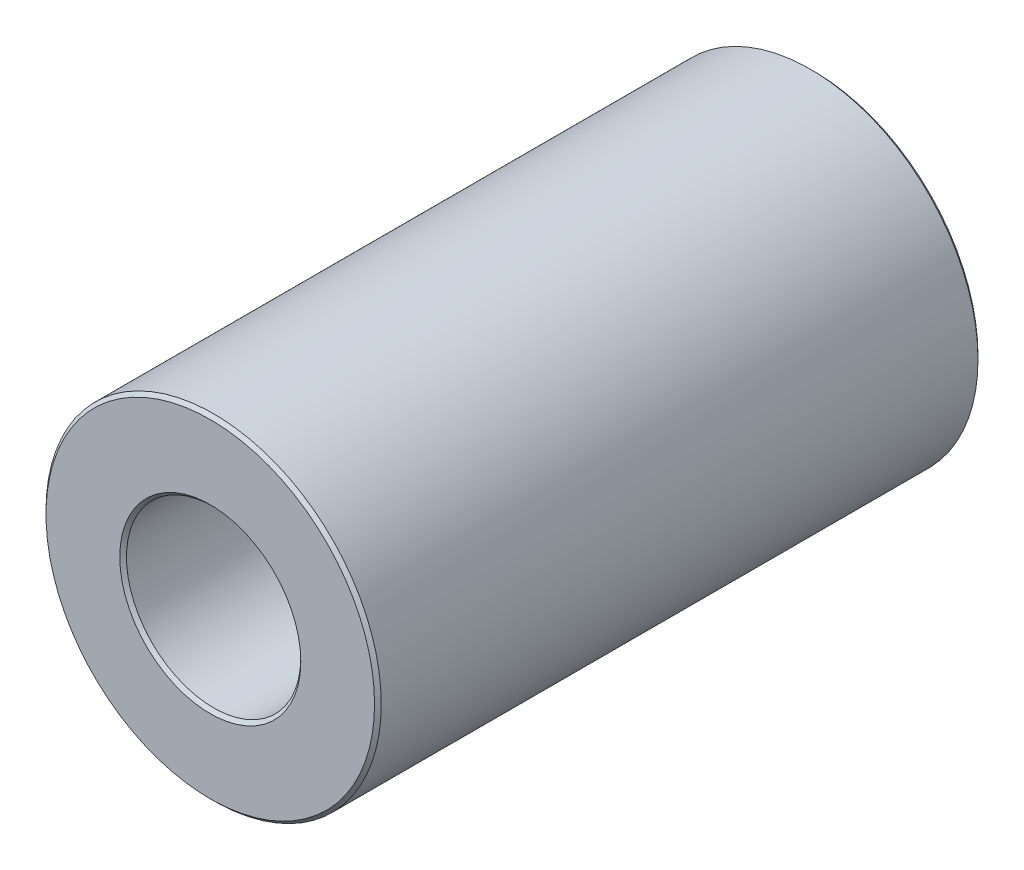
ISO-10303-21;
HEADER;
FILE_DESCRIPTION(('STEP AP214'),'2;1');
FILE_NAME('part.step','',(''),(''),'','','');
FILE_SCHEMA(('AUTOMOTIVE_DESIGN { 1 0 10303 214 1 1 1 1 }'));
ENDSEC;
DATA;
#1=APPLICATION_CONTEXT('core data for automotive mechanical design processes');
#2=APPLICATION_PROTOCOL_DEFINITION('international standard','automotive_design',2000,#1);
#3=PRODUCT_CONTEXT('',#1,'mechanical');
#4=PRODUCT('Part','Part','',(#3));
#5=PRODUCT_RELATED_PRODUCT_CATEGORY('part','',(#4));
#6=PRODUCT_DEFINITION_FORMATION('','',#4);
#7=PRODUCT_DEFINITION_CONTEXT('part definition',#1,'design');
#8=PRODUCT_DEFINITION('design','',#6,#7);
#9=PRODUCT_DEFINITION_SHAPE('','',#8);
#10=(LENGTH_UNIT() NAMED_UNIT(*) SI_UNIT(.MILLI.,.METRE.));
#11=(NAMED_UNIT(*) PLANE_ANGLE_UNIT() SI_UNIT($,.RADIAN.));
#12=(NAMED_UNIT(*) SI_UNIT($,.STERADIAN.) SOLID_ANGLE_UNIT());
#13=UNCERTAINTY_MEASURE_WITH_UNIT(LENGTH_MEASURE(1.E-05),#10,'distance_accuracy_value','');
#14=(GEOMETRIC_REPRESENTATION_CONTEXT(3) GLOBAL_UNCERTAINTY_ASSIGNED_CONTEXT((#13)) GLOBAL_UNIT_ASSIGNED_CONTEXT((#10,
#11,#12)) REPRESENTATION_CONTEXT('',''));
#15=CARTESIAN_POINT('',(0.,0.,0.));
#16=DIRECTION('',(0.,0.,1.));
#17=DIRECTION('',(1.,0.,0.));
#18=AXIS2_PLACEMENT_3D('',#15,#16,#17);
#19=CARTESIAN_POINT('',(0.,0.,9.));
#20=DIRECTION('',(0.,0.,1.));
#21=DIRECTION('',(1.,0.,0.));
#22=AXIS2_PLACEMENT_3D('',#19,#20,#21);
#23=PLANE('',#22);
#24=CARTESIAN_POINT('',(0.,0.,9.));
#25=DIRECTION('',(0.,0.,1.));
#26=DIRECTION('',(1.,0.,0.));
#27=AXIS2_PLACEMENT_3D('',#24,#25,#26);
#28=CIRCLE('',#27,2.70000000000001);
#29=CARTESIAN_POINT('',(2.70000000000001,0.,9.));
#30=VERTEX_POINT('',#29);
#31=EDGE_CURVE('E10',#30,#30,#28,.F.);
#32=ORIENTED_EDGE('',*,*,#31,.T.);
#33=EDGE_LOOP('',(#32));
#34=FACE_BOUND('',#33,.T.);
#35=CARTESIAN_POINT('',(0.,0.,9.));
#36=DIRECTION('',(0.,0.,1.));
#37=DIRECTION('',(1.,0.,0.));
#38=AXIS2_PLACEMENT_3D('',#35,#36,#37);
#39=CIRCLE('',#38,4.9);
#40=CARTESIAN_POINT('',(4.9,0.,9.));
#41=VERTEX_POINT('',#40);
#42=EDGE_CURVE('E45',#41,#41,#39,.T.);
#43=ORIENTED_EDGE('',*,*,#42,.T.);
#44=EDGE_LOOP('',(#43));
#45=FACE_BOUND('',#44,.T.);
#46=ADVANCED_FACE('F37',(#34,#45),#23,.T.);
#47=CARTESIAN_POINT('',(0.,0.,-9.));
#48=DIRECTION('',(0.,0.,1.));
#49=DIRECTION('',(1.,0.,0.));
#50=AXIS2_PLACEMENT_3D('',#47,#48,#49);
#51=PLANE('',#50);
#52=CARTESIAN_POINT('',(0.,0.,-9.));
#53=DIRECTION('',(0.,0.,1.));
#54=DIRECTION('',(1.,0.,0.));
#55=AXIS2_PLACEMENT_3D('',#52,#53,#54);
#56=CIRCLE('',#55,4.89999999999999);
#57=CARTESIAN_POINT('',(4.89999999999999,0.,-9.));
#58=VERTEX_POINT('',#57);
#59=EDGE_CURVE('E62',#58,#58,#56,.F.);
#60=ORIENTED_EDGE('',*,*,#59,.T.);
#61=EDGE_LOOP('',(#60));
#62=FACE_BOUND('',#61,.T.);
#63=CARTESIAN_POINT('',(0.,0.,-9.));
#64=DIRECTION('',(0.,0.,1.));
#65=DIRECTION('',(1.,0.,0.));
#66=AXIS2_PLACEMENT_3D('',#63,#64,#65);
#67=CIRCLE('',#66,2.7);
#68=CARTESIAN_POINT('',(2.7,0.,-9.));
#69=VERTEX_POINT('',#68);
#70=EDGE_CURVE('E66',#69,#69,#67,.T.);
#71=ORIENTED_EDGE('',*,*,#70,.T.);
#72=EDGE_LOOP('',(#71));
#73=FACE_BOUND('',#72,.T.);
#74=ADVANCED_FACE('F89',(#62,#73),#51,.F.);
#75=CARTESIAN_POINT('',(0.,0.,9.));
#76=DIRECTION('',(0.,0.,-1.));
#77=DIRECTION('',(-1.,0.,0.));
#78=AXIS2_PLACEMENT_3D('',#75,#76,#77);
#79=CYLINDRICAL_SURFACE('',#78,5.);
#80=CARTESIAN_POINT('',(0.,0.,-8.89999999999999));
#81=DIRECTION('',(0.,0.,1.));
#82=DIRECTION('',(1.,0.,0.));
#83=AXIS2_PLACEMENT_3D('',#80,#81,#82);
#84=CIRCLE('',#83,5.);
#85=CARTESIAN_POINT('',(5.,0.,-8.89999999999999));
#86=VERTEX_POINT('',#85);
#87=EDGE_CURVE('E70',#86,#86,#84,.T.);
#88=ORIENTED_EDGE('',*,*,#87,.T.);
#89=EDGE_LOOP('',(#88));
#90=FACE_BOUND('',#89,.T.);
#91=CARTESIAN_POINT('',(0.,0.,8.9));
#92=DIRECTION('',(0.,0.,1.));
#93=DIRECTION('',(1.,0.,0.));
#94=AXIS2_PLACEMENT_3D('',#91,#92,#93);
#95=CIRCLE('',#94,5.);
#96=CARTESIAN_POINT('',(5.,0.,8.9));
#97=VERTEX_POINT('',#96);
#98=EDGE_CURVE('E73',#97,#97,#95,.F.);
#99=ORIENTED_EDGE('',*,*,#98,.T.);
#100=EDGE_LOOP('',(#99));
#101=FACE_BOUND('',#100,.T.);
#102=ADVANCED_FACE('F78',(#90,#101),#79,.T.);
#103=CARTESIAN_POINT('',(0.,0.,9.));
#104=DIRECTION('',(0.,0.,-1.));
#105=DIRECTION('',(-1.,0.,0.));
#106=AXIS2_PLACEMENT_3D('',#103,#104,#105);
#107=CYLINDRICAL_SURFACE('',#106,2.6);
#108=CARTESIAN_POINT('',(0.,0.,-8.9));
#109=DIRECTION('',(0.,0.,1.));
#110=DIRECTION('',(1.,0.,0.));
#111=AXIS2_PLACEMENT_3D('',#108,#109,#110);
#112=CIRCLE('',#111,2.6);
#113=CARTESIAN_POINT('',(2.6,0.,-8.9));
#114=VERTEX_POINT('',#113);
#115=EDGE_CURVE('E51',#114,#114,#112,.F.);
#116=ORIENTED_EDGE('',*,*,#115,.T.);
#117=EDGE_LOOP('',(#116));
#118=FACE_BOUND('',#117,.T.);
#119=CARTESIAN_POINT('',(0.,0.,8.89999999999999));
#120=DIRECTION('',(0.,0.,1.));
#121=DIRECTION('',(1.,0.,0.));
#122=AXIS2_PLACEMENT_3D('',#119,#120,#121);
#123=CIRCLE('',#122,2.6);
#124=CARTESIAN_POINT('',(2.6,0.,8.89999999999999));
#125=VERTEX_POINT('',#124);
#126=EDGE_CURVE('E57',#125,#125,#123,.T.);
#127=ORIENTED_EDGE('',*,*,#126,.T.);
#128=EDGE_LOOP('',(#127));
#129=FACE_BOUND('',#128,.T.);
#130=ADVANCED_FACE('F97',(#118,#129),#107,.F.);
#131=CARTESIAN_POINT('',(0.,0.,-8.89999999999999));
#132=DIRECTION('',(0.,0.,1.));
#133=DIRECTION('',(1.,0.,0.));
#134=AXIS2_PLACEMENT_3D('',#131,#132,#133);
#135=CONICAL_SURFACE('',#134,5.,0.785398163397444);
#136=ORIENTED_EDGE('',*,*,#59,.F.);
#137=EDGE_LOOP('',(#136));
#138=FACE_BOUND('',#137,.T.);
#139=ORIENTED_EDGE('',*,*,#87,.F.);
#140=EDGE_LOOP('',(#139));
#141=FACE_BOUND('',#140,.T.);
#142=ADVANCED_FACE('F102',(#138,#141),#135,.T.);
#143=CARTESIAN_POINT('',(0.,0.,-9.));
#144=DIRECTION('',(0.,0.,-1.));
#145=DIRECTION('',(-1.,0.,0.));
#146=AXIS2_PLACEMENT_3D('',#143,#144,#145);
#147=CONICAL_SURFACE('',#146,2.7,0.785398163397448);
#148=ORIENTED_EDGE('',*,*,#115,.F.);
#149=EDGE_LOOP('',(#148));
#150=FACE_BOUND('',#149,.T.);
#151=ORIENTED_EDGE('',*,*,#70,.F.);
#152=EDGE_LOOP('',(#151));
#153=FACE_BOUND('',#152,.T.);
#154=ADVANCED_FACE('F86',(#150,#153),#147,.F.);
#155=CARTESIAN_POINT('',(0.,0.,8.89999999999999));
#156=DIRECTION('',(0.,0.,1.));
#157=DIRECTION('',(1.,0.,0.));
#158=AXIS2_PLACEMENT_3D('',#155,#156,#157);
#159=CONICAL_SURFACE('',#158,2.6,0.785398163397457);
#160=ORIENTED_EDGE('',*,*,#31,.F.);
#161=EDGE_LOOP('',(#160));
#162=FACE_BOUND('',#161,.T.);
#163=ORIENTED_EDGE('',*,*,#126,.F.);
#164=EDGE_LOOP('',(#163));
#165=FACE_BOUND('',#164,.T.);
#166=ADVANCED_FACE('F82',(#162,#165),#159,.F.);
#167=CARTESIAN_POINT('',(0.,0.,9.));
#168=DIRECTION('',(0.,0.,-1.));
#169=DIRECTION('',(-1.,0.,0.));
#170=AXIS2_PLACEMENT_3D('',#167,#168,#169);
#171=CONICAL_SURFACE('',#170,4.9,0.785398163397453);
#172=ORIENTED_EDGE('',*,*,#98,.F.);
#173=EDGE_LOOP('',(#172));
#174=FACE_BOUND('',#173,.T.);
#175=ORIENTED_EDGE('',*,*,#42,.F.);
#176=EDGE_LOOP('',(#175));
#177=FACE_BOUND('',#176,.T.);
#178=ADVANCED_FACE('F39',(#174,#177),#171,.T.);
#179=CLOSED_SHELL('',(#46,#74,#102,#130,#142,#154,#166,#178));
#180=MANIFOLD_SOLID_BREP('B2',#179);
#181=ADVANCED_BREP_SHAPE_REPRESENTATION('',(#18,#180),#14);
#182=SHAPE_DEFINITION_REPRESENTATION(#9,#181);
ENDSEC;
END-ISO-10303-21;
